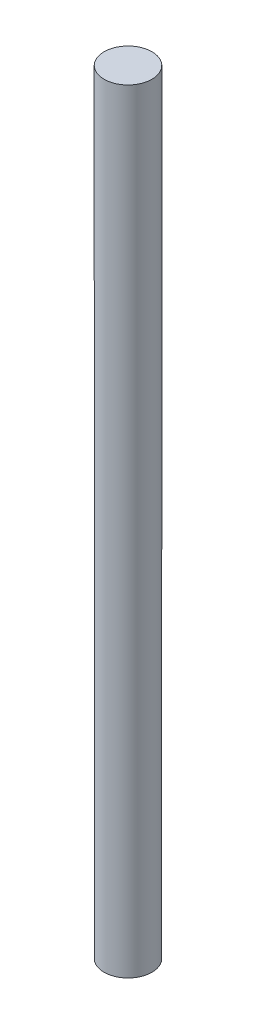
ISO-10303-21;
HEADER;
FILE_DESCRIPTION(('STEP AP214'),'2;1');
FILE_NAME('part.step','',(''),(''),'','','');
FILE_SCHEMA(('AUTOMOTIVE_DESIGN { 1 0 10303 214 1 1 1 1 }'));
ENDSEC;
DATA;
#1=APPLICATION_CONTEXT('core data for automotive mechanical design processes');
#2=APPLICATION_PROTOCOL_DEFINITION('international standard','automotive_design',2000,#1);
#3=PRODUCT_CONTEXT('',#1,'mechanical');
#4=PRODUCT('Part','Part','',(#3));
#5=PRODUCT_RELATED_PRODUCT_CATEGORY('part','',(#4));
#6=PRODUCT_DEFINITION_FORMATION('','',#4);
#7=PRODUCT_DEFINITION_CONTEXT('part definition',#1,'design');
#8=PRODUCT_DEFINITION('design','',#6,#7);
#9=PRODUCT_DEFINITION_SHAPE('','',#8);
#10=(LENGTH_UNIT() NAMED_UNIT(*) SI_UNIT(.MILLI.,.METRE.));
#11=(NAMED_UNIT(*) PLANE_ANGLE_UNIT() SI_UNIT($,.RADIAN.));
#12=(NAMED_UNIT(*) SI_UNIT($,.STERADIAN.) SOLID_ANGLE_UNIT());
#13=UNCERTAINTY_MEASURE_WITH_UNIT(LENGTH_MEASURE(1.E-05),#10,'distance_accuracy_value','');
#14=(GEOMETRIC_REPRESENTATION_CONTEXT(3) GLOBAL_UNCERTAINTY_ASSIGNED_CONTEXT((#13)) GLOBAL_UNIT_ASSIGNED_CONTEXT((#10,
#11,#12)) REPRESENTATION_CONTEXT('',''));
#15=CARTESIAN_POINT('',(0.,0.,0.));
#16=DIRECTION('',(0.,0.,1.));
#17=DIRECTION('',(1.,0.,0.));
#18=AXIS2_PLACEMENT_3D('',#15,#16,#17);
#19=CARTESIAN_POINT('',(0.,0.,0.));
#20=DIRECTION('',(0.,1.,0.));
#21=DIRECTION('',(0.,0.,1.));
#22=AXIS2_PLACEMENT_3D('',#19,#20,#21);
#23=PLANE('',#22);
#24=CARTESIAN_POINT('',(0.,0.,0.));
#25=DIRECTION('',(0.,1.,0.));
#26=DIRECTION('',(0.,0.,1.));
#27=AXIS2_PLACEMENT_3D('',#24,#25,#26);
#28=CIRCLE('',#27,6.35);
#29=CARTESIAN_POINT('',(0.,0.,6.35));
#30=VERTEX_POINT('',#29);
#31=EDGE_CURVE('E39',#30,#30,#28,.T.);
#32=ORIENTED_EDGE('',*,*,#31,.F.);
#33=EDGE_LOOP('',(#32));
#34=FACE_BOUND('',#33,.T.);
#35=ADVANCED_FACE('F32',(#34),#23,.F.);
#36=CARTESIAN_POINT('',(0.,233.701762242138,0.));
#37=DIRECTION('',(0.,-1.,0.));
#38=DIRECTION('',(0.,0.,-1.));
#39=AXIS2_PLACEMENT_3D('',#36,#37,#38);
#40=CYLINDRICAL_SURFACE('',#39,6.35);
#41=CARTESIAN_POINT('',(0.,205.58125,0.));
#42=DIRECTION('',(0.,-1.,0.));
#43=DIRECTION('',(0.,0.,-1.));
#44=AXIS2_PLACEMENT_3D('',#41,#42,#43);
#45=CIRCLE('',#44,6.35);
#46=CARTESIAN_POINT('',(0.,205.58125,-6.35));
#47=VERTEX_POINT('',#46);
#48=EDGE_CURVE('E11',#47,#47,#45,.T.);
#49=ORIENTED_EDGE('',*,*,#48,.T.);
#50=EDGE_LOOP('',(#49));
#51=FACE_BOUND('',#50,.T.);
#52=ORIENTED_EDGE('',*,*,#31,.T.);
#53=EDGE_LOOP('',(#52));
#54=FACE_BOUND('',#53,.T.);
#55=ADVANCED_FACE('F34',(#51,#54),#40,.T.);
#56=CARTESIAN_POINT('',(0.,205.58125,63.5));
#57=DIRECTION('',(0.,-1.,0.));
#58=DIRECTION('',(0.,0.,1.));
#59=AXIS2_PLACEMENT_3D('',#56,#57,#58);
#60=PLANE('',#59);
#61=ORIENTED_EDGE('',*,*,#48,.F.);
#62=EDGE_LOOP('',(#61));
#63=FACE_BOUND('',#62,.T.);
#64=ADVANCED_FACE('F50',(#63),#60,.F.);
#65=CLOSED_SHELL('',(#35,#55,#64));
#66=MANIFOLD_SOLID_BREP('B2',#65);
#67=ADVANCED_BREP_SHAPE_REPRESENTATION('',(#18,#66),#14);
#68=SHAPE_DEFINITION_REPRESENTATION(#9,#67);
ENDSEC;
END-ISO-10303-21;
